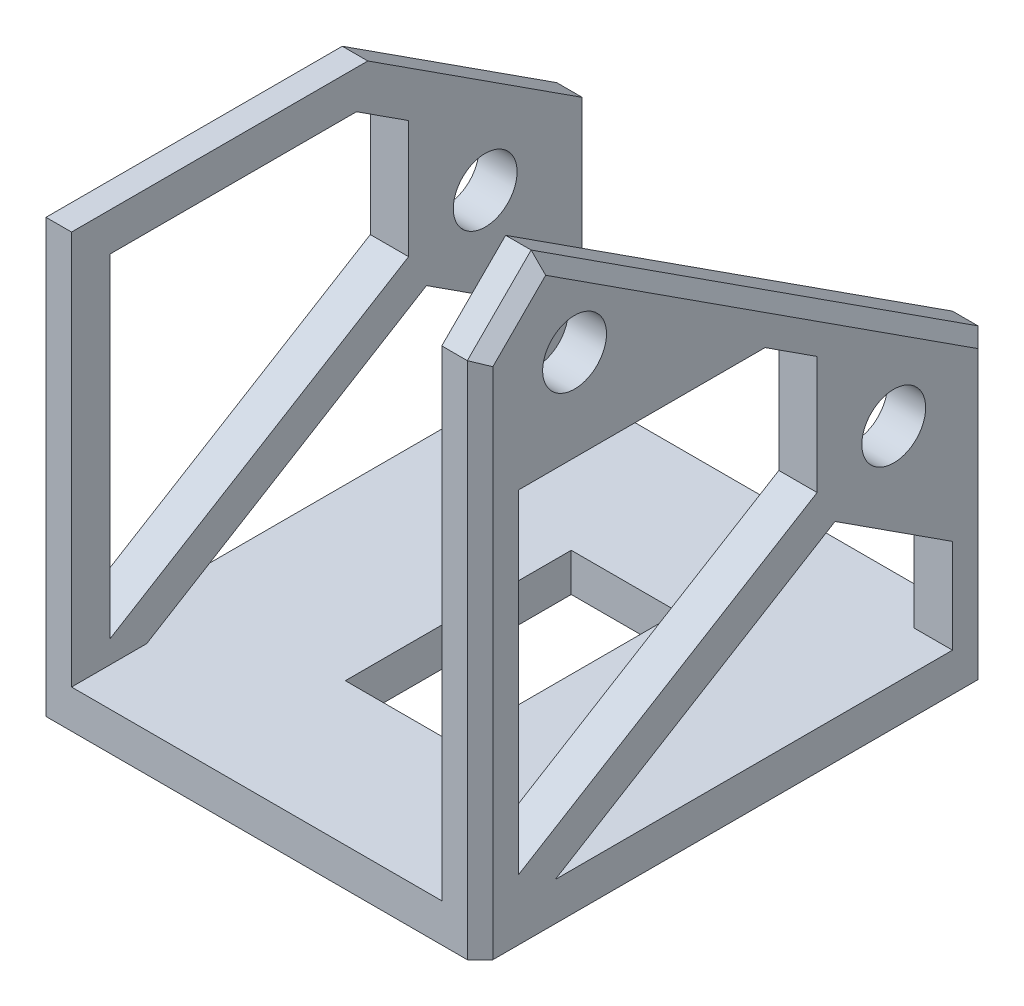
ISO-10303-21;
HEADER;
FILE_DESCRIPTION(('STEP AP214'),'2;1');
FILE_NAME('part.step','',(''),(''),'','','');
FILE_SCHEMA(('AUTOMOTIVE_DESIGN { 1 0 10303 214 1 1 1 1 }'));
ENDSEC;
DATA;
#1=APPLICATION_CONTEXT('core data for automotive mechanical design processes');
#2=APPLICATION_PROTOCOL_DEFINITION('international standard','automotive_design',2000,#1);
#3=PRODUCT_CONTEXT('',#1,'mechanical');
#4=PRODUCT('Part','Part','',(#3));
#5=PRODUCT_RELATED_PRODUCT_CATEGORY('part','',(#4));
#6=PRODUCT_DEFINITION_FORMATION('','',#4);
#7=PRODUCT_DEFINITION_CONTEXT('part definition',#1,'design');
#8=PRODUCT_DEFINITION('design','',#6,#7);
#9=PRODUCT_DEFINITION_SHAPE('','',#8);
#10=(LENGTH_UNIT() NAMED_UNIT(*) SI_UNIT(.MILLI.,.METRE.));
#11=(NAMED_UNIT(*) PLANE_ANGLE_UNIT() SI_UNIT($,.RADIAN.));
#12=(NAMED_UNIT(*) SI_UNIT($,.STERADIAN.) SOLID_ANGLE_UNIT());
#13=UNCERTAINTY_MEASURE_WITH_UNIT(LENGTH_MEASURE(1.E-05),#10,'distance_accuracy_value','');
#14=(GEOMETRIC_REPRESENTATION_CONTEXT(3) GLOBAL_UNCERTAINTY_ASSIGNED_CONTEXT((#13)) GLOBAL_UNIT_ASSIGNED_CONTEXT((#10,
#11,#12)) REPRESENTATION_CONTEXT('',''));
#15=CARTESIAN_POINT('',(0.,0.,0.));
#16=DIRECTION('',(0.,0.,1.));
#17=DIRECTION('',(1.,0.,0.));
#18=AXIS2_PLACEMENT_3D('',#15,#16,#17);
#19=CARTESIAN_POINT('',(0.,1.5,0.));
#20=DIRECTION('',(0.,1.,0.));
#21=DIRECTION('',(0.,0.,1.));
#22=AXIS2_PLACEMENT_3D('',#19,#20,#21);
#23=PLANE('',#22);
#24=DIRECTION('',(0.,0.,1.));
#25=VECTOR('',#24,1.);
#26=CARTESIAN_POINT('',(-14.5,1.5,20.));
#27=LINE('',#26,#25);
#28=CARTESIAN_POINT('',(-14.5,1.5,-20.));
#29=VERTEX_POINT('',#28);
#30=CARTESIAN_POINT('',(-14.5,1.5,-17.));
#31=VERTEX_POINT('',#30);
#32=EDGE_CURVE('E387',#29,#31,#27,.T.);
#33=ORIENTED_EDGE('',*,*,#32,.T.);
#34=DIRECTION('',(1.,0.,0.));
#35=VECTOR('',#34,1.);
#36=CARTESIAN_POINT('',(-17.5,1.5,-17.));
#37=LINE('',#36,#35);
#38=CARTESIAN_POINT('',(-17.5,1.5,-17.));
#39=VERTEX_POINT('',#38);
#40=EDGE_CURVE('E360',#39,#31,#37,.T.);
#41=ORIENTED_EDGE('',*,*,#40,.F.);
#42=DIRECTION('',(0.,0.,-1.));
#43=VECTOR('',#42,1.);
#44=CARTESIAN_POINT('',(-17.5,1.5,14.1138347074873));
#45=LINE('',#44,#43);
#46=CARTESIAN_POINT('',(-17.5,1.5,14.1138347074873));
#47=VERTEX_POINT('',#46);
#48=EDGE_CURVE('E326',#47,#39,#45,.T.);
#49=ORIENTED_EDGE('',*,*,#48,.F.);
#50=DIRECTION('',(1.,0.,0.));
#51=VECTOR('',#50,1.);
#52=CARTESIAN_POINT('',(-17.5,1.5,14.1138347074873));
#53=LINE('',#52,#51);
#54=CARTESIAN_POINT('',(-14.5,1.5,14.1138347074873));
#55=VERTEX_POINT('',#54);
#56=EDGE_CURVE('E347',#47,#55,#53,.T.);
#57=ORIENTED_EDGE('',*,*,#56,.T.);
#58=CARTESIAN_POINT('',(-14.5,1.5,20.));
#59=VERTEX_POINT('',#58);
#60=EDGE_CURVE('E382',#55,#59,#27,.T.);
#61=ORIENTED_EDGE('',*,*,#60,.T.);
#62=DIRECTION('',(1.,0.,0.));
#63=VECTOR('',#62,1.);
#64=CARTESIAN_POINT('',(-17.5,1.5,20.));
#65=LINE('',#64,#63);
#66=CARTESIAN_POINT('',(14.5,1.5,20.));
#67=VERTEX_POINT('',#66);
#68=EDGE_CURVE('E482',#59,#67,#65,.T.);
#69=ORIENTED_EDGE('',*,*,#68,.T.);
#70=DIRECTION('',(0.,0.,-1.));
#71=VECTOR('',#70,1.);
#72=CARTESIAN_POINT('',(14.5,1.5,20.));
#73=LINE('',#72,#71);
#74=CARTESIAN_POINT('',(14.5,1.5,14.1138347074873));
#75=VERTEX_POINT('',#74);
#76=EDGE_CURVE('E424',#67,#75,#73,.T.);
#77=ORIENTED_EDGE('',*,*,#76,.T.);
#78=CARTESIAN_POINT('',(17.5,1.5,14.1138347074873));
#79=VERTEX_POINT('',#78);
#80=EDGE_CURVE('E351',#75,#79,#53,.T.);
#81=ORIENTED_EDGE('',*,*,#80,.T.);
#82=DIRECTION('',(0.,0.,-1.));
#83=VECTOR('',#82,1.);
#84=CARTESIAN_POINT('',(17.5,1.5,14.1138347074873));
#85=LINE('',#84,#83);
#86=CARTESIAN_POINT('',(17.5,1.5,-17.));
#87=VERTEX_POINT('',#86);
#88=EDGE_CURVE('E62',#79,#87,#85,.T.);
#89=ORIENTED_EDGE('',*,*,#88,.T.);
#90=CARTESIAN_POINT('',(14.5,1.5,-17.));
#91=VERTEX_POINT('',#90);
#92=EDGE_CURVE('E338',#91,#87,#37,.T.);
#93=ORIENTED_EDGE('',*,*,#92,.F.);
#94=CARTESIAN_POINT('',(14.5,1.5,-20.));
#95=VERTEX_POINT('',#94);
#96=EDGE_CURVE('E421',#91,#95,#73,.T.);
#97=ORIENTED_EDGE('',*,*,#96,.T.);
#98=DIRECTION('',(-1.,0.,0.));
#99=VECTOR('',#98,1.);
#100=CARTESIAN_POINT('',(-17.5,1.5,-20.));
#101=LINE('',#100,#99);
#102=EDGE_CURVE('E480',#95,#29,#101,.T.);
#103=ORIENTED_EDGE('',*,*,#102,.T.);
#104=EDGE_LOOP('',(#33,#41,#49,#57,#61,#69,#77,#81,#89,#93,#97,#103));
#105=FACE_BOUND('',#104,.T.);
#106=DIRECTION('',(-1.,0.,0.));
#107=VECTOR('',#106,1.);
#108=CARTESIAN_POINT('',(-4.2067741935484,1.5,-8.8475806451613));
#109=LINE('',#108,#107);
#110=CARTESIAN_POINT('',(4.2067741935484,1.5,-8.8475806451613));
#111=VERTEX_POINT('',#110);
#112=CARTESIAN_POINT('',(-4.2067741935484,1.5,-8.8475806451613));
#113=VERTEX_POINT('',#112);
#114=EDGE_CURVE('E451',#111,#113,#109,.T.);
#115=ORIENTED_EDGE('',*,*,#114,.F.);
#116=DIRECTION('',(0.,0.,-1.));
#117=VECTOR('',#116,1.);
#118=CARTESIAN_POINT('',(4.2067741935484,1.5,-8.8475806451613));
#119=LINE('',#118,#117);
#120=CARTESIAN_POINT('',(4.2067741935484,1.5,8.84758064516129));
#121=VERTEX_POINT('',#120);
#122=EDGE_CURVE('E449',#121,#111,#119,.T.);
#123=ORIENTED_EDGE('',*,*,#122,.F.);
#124=DIRECTION('',(1.,0.,0.));
#125=VECTOR('',#124,1.);
#126=CARTESIAN_POINT('',(-4.2067741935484,1.5,8.84758064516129));
#127=LINE('',#126,#125);
#128=CARTESIAN_POINT('',(-4.2067741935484,1.5,8.84758064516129));
#129=VERTEX_POINT('',#128);
#130=EDGE_CURVE('E457',#129,#121,#127,.T.);
#131=ORIENTED_EDGE('',*,*,#130,.F.);
#132=DIRECTION('',(0.,0.,1.));
#133=VECTOR('',#132,1.);
#134=CARTESIAN_POINT('',(-4.2067741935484,1.5,-8.8475806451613));
#135=LINE('',#134,#133);
#136=EDGE_CURVE('E454',#113,#129,#135,.T.);
#137=ORIENTED_EDGE('',*,*,#136,.F.);
#138=EDGE_LOOP('',(#115,#123,#131,#137));
#139=FACE_BOUND('',#138,.T.);
#140=ADVANCED_FACE('F38',(#105,#139),#23,.T.);
#141=CARTESIAN_POINT('',(0.,-1.5,0.));
#142=DIRECTION('',(0.,1.,0.));
#143=DIRECTION('',(0.,0.,1.));
#144=AXIS2_PLACEMENT_3D('',#141,#142,#143);
#145=PLANE('',#144);
#146=DIRECTION('',(0.,0.,1.));
#147=VECTOR('',#146,1.);
#148=CARTESIAN_POINT('',(-17.5,-1.5,-20.));
#149=LINE('',#148,#147);
#150=CARTESIAN_POINT('',(-17.5,-1.5,-19.));
#151=VERTEX_POINT('',#150);
#152=CARTESIAN_POINT('',(-17.5,-1.5,19.));
#153=VERTEX_POINT('',#152);
#154=EDGE_CURVE('E491',#151,#153,#149,.T.);
#155=ORIENTED_EDGE('',*,*,#154,.F.);
#156=DIRECTION('',(-0.707106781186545,0.,0.70710678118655));
#157=VECTOR('',#156,1.);
#158=CARTESIAN_POINT('',(-17.5,-1.5,-19.));
#159=LINE('',#158,#157);
#160=CARTESIAN_POINT('',(-16.5,-1.5,-20.));
#161=VERTEX_POINT('',#160);
#162=EDGE_CURVE('E510',#151,#161,#159,.F.);
#163=ORIENTED_EDGE('',*,*,#162,.T.);
#164=DIRECTION('',(-1.,0.,0.));
#165=VECTOR('',#164,1.);
#166=CARTESIAN_POINT('',(-17.5,-1.5,-20.));
#167=LINE('',#166,#165);
#168=CARTESIAN_POINT('',(16.5,-1.5,-20.));
#169=VERTEX_POINT('',#168);
#170=EDGE_CURVE('E488',#169,#161,#167,.T.);
#171=ORIENTED_EDGE('',*,*,#170,.F.);
#172=DIRECTION('',(-0.707106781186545,0.,-0.70710678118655));
#173=VECTOR('',#172,1.);
#174=CARTESIAN_POINT('',(16.5,-1.5,-20.));
#175=LINE('',#174,#173);
#176=CARTESIAN_POINT('',(17.5,-1.5,-19.));
#177=VERTEX_POINT('',#176);
#178=EDGE_CURVE('E506',#169,#177,#175,.F.);
#179=ORIENTED_EDGE('',*,*,#178,.T.);
#180=DIRECTION('',(0.,0.,-1.));
#181=VECTOR('',#180,1.);
#182=CARTESIAN_POINT('',(17.5,-1.5,-20.));
#183=LINE('',#182,#181);
#184=CARTESIAN_POINT('',(17.5,-1.5,19.));
#185=VERTEX_POINT('',#184);
#186=EDGE_CURVE('E479',#185,#177,#183,.T.);
#187=ORIENTED_EDGE('',*,*,#186,.F.);
#188=DIRECTION('',(0.707106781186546,0.,-0.707106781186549));
#189=VECTOR('',#188,1.);
#190=CARTESIAN_POINT('',(17.5,-1.5,19.));
#191=LINE('',#190,#189);
#192=CARTESIAN_POINT('',(16.5,-1.5,20.));
#193=VERTEX_POINT('',#192);
#194=EDGE_CURVE('E504',#185,#193,#191,.F.);
#195=ORIENTED_EDGE('',*,*,#194,.T.);
#196=DIRECTION('',(1.,0.,0.));
#197=VECTOR('',#196,1.);
#198=CARTESIAN_POINT('',(-17.5,-1.5,20.));
#199=LINE('',#198,#197);
#200=CARTESIAN_POINT('',(-16.5,-1.5,20.));
#201=VERTEX_POINT('',#200);
#202=EDGE_CURVE('E483',#201,#193,#199,.T.);
#203=ORIENTED_EDGE('',*,*,#202,.F.);
#204=DIRECTION('',(0.707106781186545,0.,0.70710678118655));
#205=VECTOR('',#204,1.);
#206=CARTESIAN_POINT('',(-16.5,-1.5,20.));
#207=LINE('',#206,#205);
#208=EDGE_CURVE('E508',#201,#153,#207,.F.);
#209=ORIENTED_EDGE('',*,*,#208,.T.);
#210=EDGE_LOOP('',(#155,#163,#171,#179,#187,#195,#203,#209));
#211=FACE_BOUND('',#210,.T.);
#212=DIRECTION('',(0.,0.,-1.));
#213=VECTOR('',#212,1.);
#214=CARTESIAN_POINT('',(4.2067741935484,-1.5,-8.8475806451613));
#215=LINE('',#214,#213);
#216=CARTESIAN_POINT('',(4.2067741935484,-1.5,8.84758064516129));
#217=VERTEX_POINT('',#216);
#218=CARTESIAN_POINT('',(4.2067741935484,-1.5,-8.8475806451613));
#219=VERTEX_POINT('',#218);
#220=EDGE_CURVE('E443',#217,#219,#215,.T.);
#221=ORIENTED_EDGE('',*,*,#220,.T.);
#222=DIRECTION('',(-1.,0.,0.));
#223=VECTOR('',#222,1.);
#224=CARTESIAN_POINT('',(-4.2067741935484,-1.5,-8.8475806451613));
#225=LINE('',#224,#223);
#226=CARTESIAN_POINT('',(-4.2067741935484,-1.5,-8.8475806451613));
#227=VERTEX_POINT('',#226);
#228=EDGE_CURVE('E462',#219,#227,#225,.T.);
#229=ORIENTED_EDGE('',*,*,#228,.T.);
#230=DIRECTION('',(0.,0.,1.));
#231=VECTOR('',#230,1.);
#232=CARTESIAN_POINT('',(-4.2067741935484,-1.5,-8.8475806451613));
#233=LINE('',#232,#231);
#234=CARTESIAN_POINT('',(-4.2067741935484,-1.5,8.84758064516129));
#235=VERTEX_POINT('',#234);
#236=EDGE_CURVE('E465',#227,#235,#233,.T.);
#237=ORIENTED_EDGE('',*,*,#236,.T.);
#238=DIRECTION('',(1.,0.,0.));
#239=VECTOR('',#238,1.);
#240=CARTESIAN_POINT('',(-4.2067741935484,-1.5,8.84758064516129));
#241=LINE('',#240,#239);
#242=EDGE_CURVE('E452',#235,#217,#241,.T.);
#243=ORIENTED_EDGE('',*,*,#242,.T.);
#244=EDGE_LOOP('',(#221,#229,#237,#243));
#245=FACE_BOUND('',#244,.T.);
#246=ADVANCED_FACE('F623',(#211,#245),#145,.F.);
#247=CARTESIAN_POINT('',(17.5,1.5,-20.));
#248=DIRECTION('',(-1.,0.,0.));
#249=DIRECTION('',(0.,0.,1.));
#250=AXIS2_PLACEMENT_3D('',#247,#248,#249);
#251=PLANE('',#250);
#252=DIRECTION('',(0.,0.543154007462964,0.839633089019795));
#253=VECTOR('',#252,1.);
#254=CARTESIAN_POINT('',(17.5,26.7243500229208,-6.40065792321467));
#255=LINE('',#254,#253);
#256=CARTESIAN_POINT('',(17.5,26.7243500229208,-6.40065792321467));
#257=VERTEX_POINT('',#256);
#258=CARTESIAN_POINT('',(17.5,29.3630801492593,-2.32158440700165));
#259=VERTEX_POINT('',#258);
#260=EDGE_CURVE('E303',#257,#259,#255,.T.);
#261=ORIENTED_EDGE('',*,*,#260,.F.);
#262=DIRECTION('',(0.,1.,0.));
#263=VECTOR('',#262,1.);
#264=CARTESIAN_POINT('',(17.5,17.4911374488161,-6.40065792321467));
#265=LINE('',#264,#263);
#266=CARTESIAN_POINT('',(17.5,17.4911374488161,-6.40065792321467));
#267=VERTEX_POINT('',#266);
#268=EDGE_CURVE('E54',#267,#257,#265,.T.);
#269=ORIENTED_EDGE('',*,*,#268,.F.);
#270=DIRECTION('',(0.,0.519720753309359,-0.85433619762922));
#271=VECTOR('',#270,1.);
#272=CARTESIAN_POINT('',(17.5,3.2557490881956,17.));
#273=LINE('',#272,#271);
#274=CARTESIAN_POINT('',(17.5,3.2557490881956,17.));
#275=VERTEX_POINT('',#274);
#276=EDGE_CURVE('E288',#275,#267,#273,.T.);
#277=ORIENTED_EDGE('',*,*,#276,.F.);
#278=DIRECTION('',(0.,-1.,0.));
#279=VECTOR('',#278,1.);
#280=CARTESIAN_POINT('',(17.5,29.3630801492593,17.));
#281=LINE('',#280,#279);
#282=CARTESIAN_POINT('',(17.5,29.3630801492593,17.));
#283=VERTEX_POINT('',#282);
#284=EDGE_CURVE('E295',#283,#275,#281,.T.);
#285=ORIENTED_EDGE('',*,*,#284,.F.);
#286=DIRECTION('',(0.,0.,1.));
#287=VECTOR('',#286,1.);
#288=CARTESIAN_POINT('',(17.5,29.3630801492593,-2.32158440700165));
#289=LINE('',#288,#287);
#290=EDGE_CURVE('E307',#259,#283,#289,.T.);
#291=ORIENTED_EDGE('',*,*,#290,.F.);
#292=EDGE_LOOP('',(#261,#269,#277,#285,#291));
#293=FACE_BOUND('',#292,.T.);
#294=DIRECTION('',(0.,1.,0.));
#295=VECTOR('',#294,1.);
#296=CARTESIAN_POINT('',(17.5,1.5,-17.));
#297=LINE('',#296,#295);
#298=CARTESIAN_POINT('',(17.5,8.87873251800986,-17.));
#299=VERTEX_POINT('',#298);
#300=EDGE_CURVE('E305',#87,#299,#297,.T.);
#301=ORIENTED_EDGE('',*,*,#300,.F.);
#302=ORIENTED_EDGE('',*,*,#88,.F.);
#303=DIRECTION('',(0.,-0.519720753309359,0.854336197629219));
#304=VECTOR('',#303,1.);
#305=CARTESIAN_POINT('',(17.5,14.8305447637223,-7.79940784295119));
#306=LINE('',#305,#304);
#307=CARTESIAN_POINT('',(17.5,14.8305447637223,-7.79940784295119));
#308=VERTEX_POINT('',#307);
#309=EDGE_CURVE('E330',#308,#79,#306,.T.);
#310=ORIENTED_EDGE('',*,*,#309,.F.);
#311=DIRECTION('',(0.,0.543154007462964,0.839633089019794));
#312=VECTOR('',#311,1.);
#313=CARTESIAN_POINT('',(17.5,8.87873251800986,-17.));
#314=LINE('',#313,#312);
#315=EDGE_CURVE('E342',#299,#308,#314,.T.);
#316=ORIENTED_EDGE('',*,*,#315,.F.);
#317=EDGE_LOOP('',(#301,#302,#310,#316));
#318=FACE_BOUND('',#317,.T.);
#319=ORIENTED_EDGE('',*,*,#186,.T.);
#320=DIRECTION('',(0.,1.,0.));
#321=VECTOR('',#320,1.);
#322=CARTESIAN_POINT('',(17.5,1.5,-19.));
#323=LINE('',#322,#321);
#324=CARTESIAN_POINT('',(17.5,20.9558980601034,-19.));
#325=VERTEX_POINT('',#324);
#326=EDGE_CURVE('E531',#177,#325,#323,.T.);
#327=ORIENTED_EDGE('',*,*,#326,.T.);
#328=DIRECTION('',(0.,0.543154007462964,0.839633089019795));
#329=VECTOR('',#328,1.);
#330=CARTESIAN_POINT('',(17.5,43.3016735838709,15.543154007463));
#331=LINE('',#330,#329);
#332=CARTESIAN_POINT('',(17.5,42.8626313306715,14.8644617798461));
#333=VERTEX_POINT('',#332);
#334=EDGE_CURVE('E525',#325,#333,#331,.T.);
#335=ORIENTED_EDGE('',*,*,#334,.T.);
#336=DIRECTION('',(0.,-0.707106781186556,0.707106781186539));
#337=VECTOR('',#336,1.);
#338=CARTESIAN_POINT('',(17.5,38.4341998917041,19.2928932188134));
#339=LINE('',#338,#337);
#340=CARTESIAN_POINT('',(17.5,38.7270931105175,19.));
#341=VERTEX_POINT('',#340);
#342=EDGE_CURVE('E527',#333,#341,#339,.T.);
#343=ORIENTED_EDGE('',*,*,#342,.T.);
#344=DIRECTION('',(0.,-1.,0.));
#345=VECTOR('',#344,1.);
#346=CARTESIAN_POINT('',(17.5,1.5,19.));
#347=LINE('',#346,#345);
#348=EDGE_CURVE('E529',#341,#185,#347,.T.);
#349=ORIENTED_EDGE('',*,*,#348,.T.);
#350=EDGE_LOOP('',(#319,#327,#335,#343,#349));
#351=FACE_BOUND('',#350,.T.);
#352=CARTESIAN_POINT('',(17.5,36.51,12.5993420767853));
#353=DIRECTION('',(1.,0.,0.));
#354=DIRECTION('',(0.,0.,-1.));
#355=AXIS2_PLACEMENT_3D('',#352,#353,#354);
#356=CIRCLE('',#355,2.5);
#357=CARTESIAN_POINT('',(17.5,36.51,10.0993420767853));
#358=VERTEX_POINT('',#357);
#359=EDGE_CURVE('E406',#358,#358,#356,.T.);
#360=ORIENTED_EDGE('',*,*,#359,.F.);
#361=EDGE_LOOP('',(#360));
#362=FACE_BOUND('',#361,.T.);
#363=CARTESIAN_POINT('',(17.5,19.,-12.4006579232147));
#364=DIRECTION('',(1.,0.,0.));
#365=DIRECTION('',(0.,0.,-1.));
#366=AXIS2_PLACEMENT_3D('',#363,#364,#365);
#367=CIRCLE('',#366,2.5);
#368=CARTESIAN_POINT('',(17.5,19.,-14.9006579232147));
#369=VERTEX_POINT('',#368);
#370=EDGE_CURVE('E415',#369,#369,#367,.T.);
#371=ORIENTED_EDGE('',*,*,#370,.F.);
#372=EDGE_LOOP('',(#371));
#373=FACE_BOUND('',#372,.T.);
#374=ADVANCED_FACE('F299',(#293,#318,#351,#362,#373),#251,.F.);
#375=CARTESIAN_POINT('',(-17.5,1.5,-20.));
#376=DIRECTION('',(0.,0.,1.));
#377=DIRECTION('',(1.,0.,0.));
#378=AXIS2_PLACEMENT_3D('',#375,#376,#377);
#379=PLANE('',#378);
#380=ORIENTED_EDGE('',*,*,#170,.T.);
#381=DIRECTION('',(0.,1.,0.));
#382=VECTOR('',#381,1.);
#383=CARTESIAN_POINT('',(-16.5,1.5,-20.));
#384=LINE('',#383,#382);
#385=CARTESIAN_POINT('',(-16.5,21.5,-20.));
#386=VERTEX_POINT('',#385);
#387=EDGE_CURVE('E515',#161,#386,#384,.T.);
#388=ORIENTED_EDGE('',*,*,#387,.T.);
#389=DIRECTION('',(-1.,0.,0.));
#390=VECTOR('',#389,1.);
#391=CARTESIAN_POINT('',(-14.5,21.5,-20.));
#392=LINE('',#391,#390);
#393=CARTESIAN_POINT('',(-14.5,21.5,-20.));
#394=VERTEX_POINT('',#393);
#395=EDGE_CURVE('E403',#394,#386,#392,.T.);
#396=ORIENTED_EDGE('',*,*,#395,.F.);
#397=DIRECTION('',(0.,-1.,0.));
#398=VECTOR('',#397,1.);
#399=CARTESIAN_POINT('',(-14.5,1.5,-20.));
#400=LINE('',#399,#398);
#401=EDGE_CURVE('E399',#394,#29,#400,.T.);
#402=ORIENTED_EDGE('',*,*,#401,.T.);
#403=ORIENTED_EDGE('',*,*,#102,.F.);
#404=DIRECTION('',(0.,1.,0.));
#405=VECTOR('',#404,1.);
#406=CARTESIAN_POINT('',(14.5,21.5,-20.));
#407=LINE('',#406,#405);
#408=CARTESIAN_POINT('',(14.5,21.5,-20.));
#409=VERTEX_POINT('',#408);
#410=EDGE_CURVE('E427',#95,#409,#407,.T.);
#411=ORIENTED_EDGE('',*,*,#410,.T.);
#412=DIRECTION('',(1.,0.,0.));
#413=VECTOR('',#412,1.);
#414=CARTESIAN_POINT('',(14.5,21.5,-20.));
#415=LINE('',#414,#413);
#416=CARTESIAN_POINT('',(16.5,21.5,-20.));
#417=VERTEX_POINT('',#416);
#418=EDGE_CURVE('E439',#409,#417,#415,.T.);
#419=ORIENTED_EDGE('',*,*,#418,.T.);
#420=DIRECTION('',(0.,-1.,0.));
#421=VECTOR('',#420,1.);
#422=CARTESIAN_POINT('',(16.5,1.5,-20.));
#423=LINE('',#422,#421);
#424=EDGE_CURVE('E512',#417,#169,#423,.T.);
#425=ORIENTED_EDGE('',*,*,#424,.T.);
#426=EDGE_LOOP('',(#380,#388,#396,#402,#403,#411,#419,#425));
#427=FACE_BOUND('',#426,.T.);
#428=ADVANCED_FACE('F642',(#427),#379,.F.);
#429=CARTESIAN_POINT('',(-17.5,1.5,-20.));
#430=DIRECTION('',(1.,0.,0.));
#431=DIRECTION('',(0.,0.,-1.));
#432=AXIS2_PLACEMENT_3D('',#429,#430,#431);
#433=PLANE('',#432);
#434=DIRECTION('',(0.,0.519720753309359,-0.85433619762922));
#435=VECTOR('',#434,1.);
#436=CARTESIAN_POINT('',(-17.5,3.2557490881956,17.));
#437=LINE('',#436,#435);
#438=CARTESIAN_POINT('',(-17.5,3.2557490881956,17.));
#439=VERTEX_POINT('',#438);
#440=CARTESIAN_POINT('',(-17.5,17.4911374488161,-6.40065792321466));
#441=VERTEX_POINT('',#440);
#442=EDGE_CURVE('E311',#439,#441,#437,.T.);
#443=ORIENTED_EDGE('',*,*,#442,.T.);
#444=DIRECTION('',(0.,1.,0.));
#445=VECTOR('',#444,1.);
#446=CARTESIAN_POINT('',(-17.5,17.4911374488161,-6.40065792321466));
#447=LINE('',#446,#445);
#448=CARTESIAN_POINT('',(-17.5,26.7243500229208,-6.40065792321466));
#449=VERTEX_POINT('',#448);
#450=EDGE_CURVE('E296',#441,#449,#447,.T.);
#451=ORIENTED_EDGE('',*,*,#450,.T.);
#452=DIRECTION('',(0.,0.543154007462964,0.839633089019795));
#453=VECTOR('',#452,1.);
#454=CARTESIAN_POINT('',(-17.5,26.7243500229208,-6.40065792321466));
#455=LINE('',#454,#453);
#456=CARTESIAN_POINT('',(-17.5,29.3630801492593,-2.32158440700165));
#457=VERTEX_POINT('',#456);
#458=EDGE_CURVE('E321',#449,#457,#455,.T.);
#459=ORIENTED_EDGE('',*,*,#458,.T.);
#460=DIRECTION('',(0.,0.,1.));
#461=VECTOR('',#460,1.);
#462=CARTESIAN_POINT('',(-17.5,29.3630801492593,-2.32158440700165));
#463=LINE('',#462,#461);
#464=CARTESIAN_POINT('',(-17.5,29.3630801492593,17.));
#465=VERTEX_POINT('',#464);
#466=EDGE_CURVE('E318',#457,#465,#463,.T.);
#467=ORIENTED_EDGE('',*,*,#466,.T.);
#468=DIRECTION('',(0.,-1.,0.));
#469=VECTOR('',#468,1.);
#470=CARTESIAN_POINT('',(-17.5,29.3630801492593,17.));
#471=LINE('',#470,#469);
#472=EDGE_CURVE('E314',#465,#439,#471,.T.);
#473=ORIENTED_EDGE('',*,*,#472,.T.);
#474=EDGE_LOOP('',(#443,#451,#459,#467,#473));
#475=FACE_BOUND('',#474,.T.);
#476=DIRECTION('',(0.,-0.519720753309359,0.854336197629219));
#477=VECTOR('',#476,1.);
#478=CARTESIAN_POINT('',(-17.5,14.8305447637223,-7.79940784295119));
#479=LINE('',#478,#477);
#480=CARTESIAN_POINT('',(-17.5,14.8305447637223,-7.79940784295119));
#481=VERTEX_POINT('',#480);
#482=EDGE_CURVE('E336',#481,#47,#479,.T.);
#483=ORIENTED_EDGE('',*,*,#482,.T.);
#484=ORIENTED_EDGE('',*,*,#48,.T.);
#485=DIRECTION('',(0.,1.,0.));
#486=VECTOR('',#485,1.);
#487=CARTESIAN_POINT('',(-17.5,1.5,-17.));
#488=LINE('',#487,#486);
#489=CARTESIAN_POINT('',(-17.5,8.87873251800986,-17.));
#490=VERTEX_POINT('',#489);
#491=EDGE_CURVE('E329',#39,#490,#488,.T.);
#492=ORIENTED_EDGE('',*,*,#491,.T.);
#493=DIRECTION('',(0.,0.543154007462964,0.839633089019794));
#494=VECTOR('',#493,1.);
#495=CARTESIAN_POINT('',(-17.5,8.87873251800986,-17.));
#496=LINE('',#495,#494);
#497=EDGE_CURVE('E333',#490,#481,#496,.T.);
#498=ORIENTED_EDGE('',*,*,#497,.T.);
#499=EDGE_LOOP('',(#483,#484,#492,#498));
#500=FACE_BOUND('',#499,.T.);
#501=DIRECTION('',(0.,-0.543154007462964,-0.839633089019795));
#502=VECTOR('',#501,1.);
#503=CARTESIAN_POINT('',(-17.5,20.6603669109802,-19.456845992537));
#504=LINE('',#503,#502);
#505=CARTESIAN_POINT('',(-17.5,31.3630801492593,-2.91208694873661));
#506=VERTEX_POINT('',#505);
#507=CARTESIAN_POINT('',(-17.5,20.9558980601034,-19.));
#508=VERTEX_POINT('',#507);
#509=EDGE_CURVE('E499',#506,#508,#504,.T.);
#510=ORIENTED_EDGE('',*,*,#509,.T.);
#511=DIRECTION('',(0.,-1.,0.));
#512=VECTOR('',#511,1.);
#513=CARTESIAN_POINT('',(-17.5,1.5,-19.));
#514=LINE('',#513,#512);
#515=EDGE_CURVE('E501',#508,#151,#514,.T.);
#516=ORIENTED_EDGE('',*,*,#515,.T.);
#517=ORIENTED_EDGE('',*,*,#154,.T.);
#518=DIRECTION('',(0.,1.,0.));
#519=VECTOR('',#518,1.);
#520=CARTESIAN_POINT('',(-17.5,1.5,19.));
#521=LINE('',#520,#519);
#522=CARTESIAN_POINT('',(-17.5,31.3630801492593,19.));
#523=VERTEX_POINT('',#522);
#524=EDGE_CURVE('E485',#153,#523,#521,.T.);
#525=ORIENTED_EDGE('',*,*,#524,.T.);
#526=DIRECTION('',(0.,0.,-1.));
#527=VECTOR('',#526,1.);
#528=CARTESIAN_POINT('',(-17.5,31.3630801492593,-3.2073382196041));
#529=LINE('',#528,#527);
#530=EDGE_CURVE('E497',#523,#506,#529,.T.);
#531=ORIENTED_EDGE('',*,*,#530,.T.);
#532=EDGE_LOOP('',(#510,#516,#517,#525,#531));
#533=FACE_BOUND('',#532,.T.);
#534=CARTESIAN_POINT('',(-17.5,19.,-12.4006579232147));
#535=DIRECTION('',(-1.,0.,0.));
#536=DIRECTION('',(0.,0.,1.));
#537=AXIS2_PLACEMENT_3D('',#534,#535,#536);
#538=CIRCLE('',#537,2.5);
#539=CARTESIAN_POINT('',(-17.5,19.,-9.90065792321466));
#540=VERTEX_POINT('',#539);
#541=EDGE_CURVE('E383',#540,#540,#538,.T.);
#542=ORIENTED_EDGE('',*,*,#541,.F.);
#543=EDGE_LOOP('',(#542));
#544=FACE_BOUND('',#543,.T.);
#545=ADVANCED_FACE('F638',(#475,#500,#533,#544),#433,.F.);
#546=CARTESIAN_POINT('',(-17.5,1.5,20.));
#547=DIRECTION('',(0.,0.,-1.));
#548=DIRECTION('',(-1.,0.,0.));
#549=AXIS2_PLACEMENT_3D('',#546,#547,#548);
#550=PLANE('',#549);
#551=DIRECTION('',(-1.,0.,0.));
#552=VECTOR('',#551,1.);
#553=CARTESIAN_POINT('',(-14.5,32.3630801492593,20.));
#554=LINE('',#553,#552);
#555=CARTESIAN_POINT('',(-14.5,32.3630801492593,20.));
#556=VERTEX_POINT('',#555);
#557=CARTESIAN_POINT('',(-16.5,32.3630801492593,20.));
#558=VERTEX_POINT('',#557);
#559=EDGE_CURVE('E402',#556,#558,#554,.T.);
#560=ORIENTED_EDGE('',*,*,#559,.T.);
#561=DIRECTION('',(0.,-1.,0.));
#562=VECTOR('',#561,1.);
#563=CARTESIAN_POINT('',(-16.5,1.5,20.));
#564=LINE('',#563,#562);
#565=EDGE_CURVE('E523',#558,#201,#564,.T.);
#566=ORIENTED_EDGE('',*,*,#565,.T.);
#567=ORIENTED_EDGE('',*,*,#202,.T.);
#568=DIRECTION('',(0.,1.,0.));
#569=VECTOR('',#568,1.);
#570=CARTESIAN_POINT('',(16.5,1.5,20.));
#571=LINE('',#570,#569);
#572=CARTESIAN_POINT('',(16.5,39.1413066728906,20.));
#573=VERTEX_POINT('',#572);
#574=EDGE_CURVE('E521',#193,#573,#571,.T.);
#575=ORIENTED_EDGE('',*,*,#574,.T.);
#576=DIRECTION('',(1.,0.,0.));
#577=VECTOR('',#576,1.);
#578=CARTESIAN_POINT('',(14.5,39.1413066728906,20.));
#579=LINE('',#578,#577);
#580=CARTESIAN_POINT('',(14.5,39.1413066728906,20.));
#581=VERTEX_POINT('',#580);
#582=EDGE_CURVE('E440',#581,#573,#579,.T.);
#583=ORIENTED_EDGE('',*,*,#582,.F.);
#584=DIRECTION('',(0.,-1.,0.));
#585=VECTOR('',#584,1.);
#586=CARTESIAN_POINT('',(14.5,1.5,20.));
#587=LINE('',#586,#585);
#588=EDGE_CURVE('E436',#581,#67,#587,.T.);
#589=ORIENTED_EDGE('',*,*,#588,.T.);
#590=ORIENTED_EDGE('',*,*,#68,.F.);
#591=DIRECTION('',(0.,1.,0.));
#592=VECTOR('',#591,1.);
#593=CARTESIAN_POINT('',(-14.5,32.3630801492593,20.));
#594=LINE('',#593,#592);
#595=EDGE_CURVE('E390',#59,#556,#594,.T.);
#596=ORIENTED_EDGE('',*,*,#595,.T.);
#597=EDGE_LOOP('',(#560,#566,#567,#575,#583,#589,#590,#596));
#598=FACE_BOUND('',#597,.T.);
#599=ADVANCED_FACE('F635',(#598),#550,.F.);
#600=CARTESIAN_POINT('',(4.2067741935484,1.5,-8.8475806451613));
#601=DIRECTION('',(-1.,0.,0.));
#602=DIRECTION('',(0.,0.,1.));
#603=AXIS2_PLACEMENT_3D('',#600,#601,#602);
#604=PLANE('',#603);
#605=ORIENTED_EDGE('',*,*,#220,.F.);
#606=DIRECTION('',(0.,-1.,0.));
#607=VECTOR('',#606,1.);
#608=CARTESIAN_POINT('',(4.2067741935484,1.5,8.84758064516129));
#609=LINE('',#608,#607);
#610=EDGE_CURVE('E459',#121,#217,#609,.T.);
#611=ORIENTED_EDGE('',*,*,#610,.F.);
#612=ORIENTED_EDGE('',*,*,#122,.T.);
#613=DIRECTION('',(0.,-1.,0.));
#614=VECTOR('',#613,1.);
#615=CARTESIAN_POINT('',(4.2067741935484,1.5,-8.8475806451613));
#616=LINE('',#615,#614);
#617=EDGE_CURVE('E476',#111,#219,#616,.T.);
#618=ORIENTED_EDGE('',*,*,#617,.T.);
#619=EDGE_LOOP('',(#605,#611,#612,#618));
#620=FACE_BOUND('',#619,.T.);
#621=ADVANCED_FACE('F632',(#620),#604,.T.);
#622=CARTESIAN_POINT('',(-4.2067741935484,1.5,-8.8475806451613));
#623=DIRECTION('',(0.,0.,1.));
#624=DIRECTION('',(1.,0.,0.));
#625=AXIS2_PLACEMENT_3D('',#622,#623,#624);
#626=PLANE('',#625);
#627=ORIENTED_EDGE('',*,*,#228,.F.);
#628=ORIENTED_EDGE('',*,*,#617,.F.);
#629=ORIENTED_EDGE('',*,*,#114,.T.);
#630=DIRECTION('',(0.,-1.,0.));
#631=VECTOR('',#630,1.);
#632=CARTESIAN_POINT('',(-4.2067741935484,1.5,-8.8475806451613));
#633=LINE('',#632,#631);
#634=EDGE_CURVE('E474',#113,#227,#633,.T.);
#635=ORIENTED_EDGE('',*,*,#634,.T.);
#636=EDGE_LOOP('',(#627,#628,#629,#635));
#637=FACE_BOUND('',#636,.T.);
#638=ADVANCED_FACE('F1076',(#637),#626,.T.);
#639=CARTESIAN_POINT('',(-4.2067741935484,1.5,-8.8475806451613));
#640=DIRECTION('',(1.,0.,0.));
#641=DIRECTION('',(0.,0.,-1.));
#642=AXIS2_PLACEMENT_3D('',#639,#640,#641);
#643=PLANE('',#642);
#644=ORIENTED_EDGE('',*,*,#236,.F.);
#645=ORIENTED_EDGE('',*,*,#634,.F.);
#646=ORIENTED_EDGE('',*,*,#136,.T.);
#647=DIRECTION('',(0.,-1.,0.));
#648=VECTOR('',#647,1.);
#649=CARTESIAN_POINT('',(-4.2067741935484,1.5,8.84758064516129));
#650=LINE('',#649,#648);
#651=EDGE_CURVE('E472',#129,#235,#650,.T.);
#652=ORIENTED_EDGE('',*,*,#651,.T.);
#653=EDGE_LOOP('',(#644,#645,#646,#652));
#654=FACE_BOUND('',#653,.T.);
#655=ADVANCED_FACE('F1066',(#654),#643,.T.);
#656=CARTESIAN_POINT('',(-4.2067741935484,1.5,8.84758064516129));
#657=DIRECTION('',(0.,0.,-1.));
#658=DIRECTION('',(-1.,0.,0.));
#659=AXIS2_PLACEMENT_3D('',#656,#657,#658);
#660=PLANE('',#659);
#661=ORIENTED_EDGE('',*,*,#242,.F.);
#662=ORIENTED_EDGE('',*,*,#651,.F.);
#663=ORIENTED_EDGE('',*,*,#130,.T.);
#664=ORIENTED_EDGE('',*,*,#610,.T.);
#665=EDGE_LOOP('',(#661,#662,#663,#664));
#666=FACE_BOUND('',#665,.T.);
#667=ADVANCED_FACE('F1048',(#666),#660,.T.);
#668=CARTESIAN_POINT('',(14.5,39.1413066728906,20.));
#669=DIRECTION('',(0.,0.707106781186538,0.707106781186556));
#670=DIRECTION('',(0.,-0.707106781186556,0.707106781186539));
#671=AXIS2_PLACEMENT_3D('',#668,#669,#670);
#672=PLANE('',#671);
#673=ORIENTED_EDGE('',*,*,#582,.T.);
#674=DIRECTION('',(0.,0.707106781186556,-0.707106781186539));
#675=VECTOR('',#674,1.);
#676=CARTESIAN_POINT('',(16.5,44.1413066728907,15.));
#677=LINE('',#676,#675);
#678=CARTESIAN_POINT('',(16.5,44.1413066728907,15.));
#679=VERTEX_POINT('',#678);
#680=EDGE_CURVE('E533',#573,#679,#677,.T.);
#681=ORIENTED_EDGE('',*,*,#680,.T.);
#682=DIRECTION('',(1.,0.,0.));
#683=VECTOR('',#682,1.);
#684=CARTESIAN_POINT('',(14.5,44.1413066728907,15.));
#685=LINE('',#684,#683);
#686=CARTESIAN_POINT('',(14.5,44.1413066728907,15.));
#687=VERTEX_POINT('',#686);
#688=EDGE_CURVE('E444',#687,#679,#685,.T.);
#689=ORIENTED_EDGE('',*,*,#688,.F.);
#690=DIRECTION('',(0.,-0.707106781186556,0.707106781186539));
#691=VECTOR('',#690,1.);
#692=CARTESIAN_POINT('',(14.5,39.1413066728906,20.));
#693=LINE('',#692,#691);
#694=EDGE_CURVE('E433',#687,#581,#693,.T.);
#695=ORIENTED_EDGE('',*,*,#694,.T.);
#696=EDGE_LOOP('',(#673,#681,#689,#695));
#697=FACE_BOUND('',#696,.T.);
#698=ADVANCED_FACE('F729',(#697),#672,.T.);
#699=CARTESIAN_POINT('',(14.5,44.1413066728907,15.));
#700=DIRECTION('',(0.,0.839633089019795,-0.543154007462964));
#701=DIRECTION('',(0.,0.543154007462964,0.839633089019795));
#702=AXIS2_PLACEMENT_3D('',#699,#700,#701);
#703=PLANE('',#702);
#704=ORIENTED_EDGE('',*,*,#688,.T.);
#705=DIRECTION('',(0.,-0.543154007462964,-0.839633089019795));
#706=VECTOR('',#705,1.);
#707=CARTESIAN_POINT('',(16.5,21.5,-20.));
#708=LINE('',#707,#706);
#709=EDGE_CURVE('E535',#679,#417,#708,.T.);
#710=ORIENTED_EDGE('',*,*,#709,.T.);
#711=ORIENTED_EDGE('',*,*,#418,.F.);
#712=DIRECTION('',(0.,0.543154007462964,0.839633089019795));
#713=VECTOR('',#712,1.);
#714=CARTESIAN_POINT('',(14.5,44.1413066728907,15.));
#715=LINE('',#714,#713);
#716=EDGE_CURVE('E430',#409,#687,#715,.T.);
#717=ORIENTED_EDGE('',*,*,#716,.T.);
#718=EDGE_LOOP('',(#704,#710,#711,#717));
#719=FACE_BOUND('',#718,.T.);
#720=ADVANCED_FACE('F726',(#719),#703,.T.);
#721=CARTESIAN_POINT('',(14.5,0.,0.));
#722=DIRECTION('',(-1.,0.,0.));
#723=DIRECTION('',(0.,0.,1.));
#724=AXIS2_PLACEMENT_3D('',#721,#722,#723);
#725=PLANE('',#724);
#726=DIRECTION('',(0.,-1.,0.));
#727=VECTOR('',#726,1.);
#728=CARTESIAN_POINT('',(14.5,0.,-6.40065792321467));
#729=LINE('',#728,#727);
#730=CARTESIAN_POINT('',(14.5,26.7243500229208,-6.40065792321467));
#731=VERTEX_POINT('',#730);
#732=CARTESIAN_POINT('',(14.5,17.4911374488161,-6.40065792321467));
#733=VERTEX_POINT('',#732);
#734=EDGE_CURVE('E282',#731,#733,#729,.T.);
#735=ORIENTED_EDGE('',*,*,#734,.F.);
#736=DIRECTION('',(0.,-0.543154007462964,-0.839633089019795));
#737=VECTOR('',#736,1.);
#738=CARTESIAN_POINT('',(14.5,21.7592523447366,-14.0759401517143));
#739=LINE('',#738,#737);
#740=CARTESIAN_POINT('',(14.5,29.3630801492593,-2.32158440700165));
#741=VERTEX_POINT('',#740);
#742=EDGE_CURVE('E368',#741,#731,#739,.T.);
#743=ORIENTED_EDGE('',*,*,#742,.F.);
#744=DIRECTION('',(0.,0.,-1.));
#745=VECTOR('',#744,1.);
#746=CARTESIAN_POINT('',(14.5,29.3630801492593,0.));
#747=LINE('',#746,#745);
#748=CARTESIAN_POINT('',(14.5,29.3630801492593,17.));
#749=VERTEX_POINT('',#748);
#750=EDGE_CURVE('E370',#749,#741,#747,.T.);
#751=ORIENTED_EDGE('',*,*,#750,.F.);
#752=DIRECTION('',(0.,1.,0.));
#753=VECTOR('',#752,1.);
#754=CARTESIAN_POINT('',(14.5,0.,17.));
#755=LINE('',#754,#753);
#756=CARTESIAN_POINT('',(14.5,3.2557490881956,17.));
#757=VERTEX_POINT('',#756);
#758=EDGE_CURVE('E373',#757,#749,#755,.T.);
#759=ORIENTED_EDGE('',*,*,#758,.F.);
#760=DIRECTION('',(0.,-0.519720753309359,0.854336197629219));
#761=VECTOR('',#760,1.);
#762=CARTESIAN_POINT('',(14.5,9.92461609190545,6.03746975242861));
#763=LINE('',#762,#761);
#764=EDGE_CURVE('E375',#733,#757,#763,.T.);
#765=ORIENTED_EDGE('',*,*,#764,.F.);
#766=EDGE_LOOP('',(#735,#743,#751,#759,#765));
#767=FACE_BOUND('',#766,.T.);
#768=DIRECTION('',(0.,0.519720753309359,-0.854336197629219));
#769=VECTOR('',#768,1.);
#770=CARTESIAN_POINT('',(14.5,7.36160749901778,4.47830749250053));
#771=LINE('',#770,#769);
#772=CARTESIAN_POINT('',(14.5,14.8305447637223,-7.79940784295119));
#773=VERTEX_POINT('',#772);
#774=EDGE_CURVE('E366',#75,#773,#771,.T.);
#775=ORIENTED_EDGE('',*,*,#774,.F.);
#776=ORIENTED_EDGE('',*,*,#76,.F.);
#777=ORIENTED_EDGE('',*,*,#588,.F.);
#778=ORIENTED_EDGE('',*,*,#694,.F.);
#779=ORIENTED_EDGE('',*,*,#716,.F.);
#780=ORIENTED_EDGE('',*,*,#410,.F.);
#781=ORIENTED_EDGE('',*,*,#96,.F.);
#782=DIRECTION('',(0.,-1.,0.));
#783=VECTOR('',#782,1.);
#784=CARTESIAN_POINT('',(14.5,0.,-17.));
#785=LINE('',#784,#783);
#786=CARTESIAN_POINT('',(14.5,8.87873251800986,-17.));
#787=VERTEX_POINT('',#786);
#788=EDGE_CURVE('E350',#787,#91,#785,.T.);
#789=ORIENTED_EDGE('',*,*,#788,.F.);
#790=DIRECTION('',(0.,-0.543154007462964,-0.839633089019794));
#791=VECTOR('',#790,1.);
#792=CARTESIAN_POINT('',(14.5,14.0122132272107,-9.06442333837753));
#793=LINE('',#792,#791);
#794=EDGE_CURVE('E363',#773,#787,#793,.T.);
#795=ORIENTED_EDGE('',*,*,#794,.F.);
#796=EDGE_LOOP('',(#775,#776,#777,#778,#779,#780,#781,#789,#795));
#797=FACE_BOUND('',#796,.T.);
#798=CARTESIAN_POINT('',(14.5,36.51,12.5993420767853));
#799=DIRECTION('',(1.,0.,0.));
#800=DIRECTION('',(0.,0.,-1.));
#801=AXIS2_PLACEMENT_3D('',#798,#799,#800);
#802=CIRCLE('',#801,2.5);
#803=CARTESIAN_POINT('',(14.5,36.51,10.0993420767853));
#804=VERTEX_POINT('',#803);
#805=EDGE_CURVE('E412',#804,#804,#802,.T.);
#806=ORIENTED_EDGE('',*,*,#805,.T.);
#807=EDGE_LOOP('',(#806));
#808=FACE_BOUND('',#807,.T.);
#809=CARTESIAN_POINT('',(14.5,19.,-12.4006579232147));
#810=DIRECTION('',(1.,0.,0.));
#811=DIRECTION('',(0.,0.,-1.));
#812=AXIS2_PLACEMENT_3D('',#809,#810,#811);
#813=CIRCLE('',#812,2.5);
#814=CARTESIAN_POINT('',(14.5,19.,-14.9006579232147));
#815=VERTEX_POINT('',#814);
#816=EDGE_CURVE('E418',#815,#815,#813,.T.);
#817=ORIENTED_EDGE('',*,*,#816,.T.);
#818=EDGE_LOOP('',(#817));
#819=FACE_BOUND('',#818,.T.);
#820=ADVANCED_FACE('F608',(#767,#797,#808,#819),#725,.T.);
#821=CARTESIAN_POINT('',(14.5,19.,-12.4006579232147));
#822=DIRECTION('',(1.,0.,0.));
#823=DIRECTION('',(0.,0.,-1.));
#824=AXIS2_PLACEMENT_3D('',#821,#822,#823);
#825=CYLINDRICAL_SURFACE('',#824,2.5);
#826=ORIENTED_EDGE('',*,*,#816,.F.);
#827=EDGE_LOOP('',(#826));
#828=FACE_BOUND('',#827,.T.);
#829=ORIENTED_EDGE('',*,*,#370,.T.);
#830=EDGE_LOOP('',(#829));
#831=FACE_BOUND('',#830,.T.);
#832=ADVANCED_FACE('F1012',(#828,#831),#825,.F.);
#833=CARTESIAN_POINT('',(14.5,36.51,12.5993420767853));
#834=DIRECTION('',(1.,0.,0.));
#835=DIRECTION('',(0.,0.,-1.));
#836=AXIS2_PLACEMENT_3D('',#833,#834,#835);
#837=CYLINDRICAL_SURFACE('',#836,2.5);
#838=ORIENTED_EDGE('',*,*,#805,.F.);
#839=EDGE_LOOP('',(#838));
#840=FACE_BOUND('',#839,.T.);
#841=ORIENTED_EDGE('',*,*,#359,.T.);
#842=EDGE_LOOP('',(#841));
#843=FACE_BOUND('',#842,.T.);
#844=ADVANCED_FACE('F1002',(#840,#843),#837,.F.);
#845=CARTESIAN_POINT('',(-14.5,21.5,-20.));
#846=DIRECTION('',(0.,0.839633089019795,-0.543154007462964));
#847=DIRECTION('',(0.,0.543154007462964,0.839633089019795));
#848=AXIS2_PLACEMENT_3D('',#845,#846,#847);
#849=PLANE('',#848);
#850=ORIENTED_EDGE('',*,*,#395,.T.);
#851=DIRECTION('',(0.,0.543154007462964,0.839633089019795));
#852=VECTOR('',#851,1.);
#853=CARTESIAN_POINT('',(-16.5,32.3630801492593,-3.2073382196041));
#854=LINE('',#853,#852);
#855=CARTESIAN_POINT('',(-16.5,32.3630801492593,-3.2073382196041));
#856=VERTEX_POINT('',#855);
#857=EDGE_CURVE('E517',#386,#856,#854,.T.);
#858=ORIENTED_EDGE('',*,*,#857,.T.);
#859=DIRECTION('',(-1.,0.,0.));
#860=VECTOR('',#859,1.);
#861=CARTESIAN_POINT('',(-14.5,32.3630801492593,-3.2073382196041));
#862=LINE('',#861,#860);
#863=CARTESIAN_POINT('',(-14.5,32.3630801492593,-3.2073382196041));
#864=VERTEX_POINT('',#863);
#865=EDGE_CURVE('E407',#864,#856,#862,.T.);
#866=ORIENTED_EDGE('',*,*,#865,.F.);
#867=DIRECTION('',(0.,-0.543154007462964,-0.839633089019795));
#868=VECTOR('',#867,1.);
#869=CARTESIAN_POINT('',(-14.5,21.5,-20.));
#870=LINE('',#869,#868);
#871=EDGE_CURVE('E396',#864,#394,#870,.T.);
#872=ORIENTED_EDGE('',*,*,#871,.T.);
#873=EDGE_LOOP('',(#850,#858,#866,#872));
#874=FACE_BOUND('',#873,.T.);
#875=ADVANCED_FACE('F748',(#874),#849,.T.);
#876=CARTESIAN_POINT('',(-14.5,32.3630801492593,-3.2073382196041));
#877=DIRECTION('',(0.,1.,0.));
#878=DIRECTION('',(0.,0.,1.));
#879=AXIS2_PLACEMENT_3D('',#876,#877,#878);
#880=PLANE('',#879);
#881=ORIENTED_EDGE('',*,*,#865,.T.);
#882=DIRECTION('',(0.,0.,1.));
#883=VECTOR('',#882,1.);
#884=CARTESIAN_POINT('',(-16.5,32.3630801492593,20.));
#885=LINE('',#884,#883);
#886=EDGE_CURVE('E519',#856,#558,#885,.T.);
#887=ORIENTED_EDGE('',*,*,#886,.T.);
#888=ORIENTED_EDGE('',*,*,#559,.F.);
#889=DIRECTION('',(0.,0.,-1.));
#890=VECTOR('',#889,1.);
#891=CARTESIAN_POINT('',(-14.5,32.3630801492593,-3.2073382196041));
#892=LINE('',#891,#890);
#893=EDGE_CURVE('E393',#556,#864,#892,.T.);
#894=ORIENTED_EDGE('',*,*,#893,.T.);
#895=EDGE_LOOP('',(#881,#887,#888,#894));
#896=FACE_BOUND('',#895,.T.);
#897=ADVANCED_FACE('F754',(#896),#880,.T.);
#898=CARTESIAN_POINT('',(-14.5,0.,0.));
#899=DIRECTION('',(1.,0.,0.));
#900=DIRECTION('',(0.,0.,-1.));
#901=AXIS2_PLACEMENT_3D('',#898,#899,#900);
#902=PLANE('',#901);
#903=DIRECTION('',(0.,1.,0.));
#904=VECTOR('',#903,1.);
#905=CARTESIAN_POINT('',(-14.5,0.,-6.40065792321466));
#906=LINE('',#905,#904);
#907=CARTESIAN_POINT('',(-14.5,17.4911374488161,-6.40065792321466));
#908=VERTEX_POINT('',#907);
#909=CARTESIAN_POINT('',(-14.5,26.7243500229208,-6.40065792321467));
#910=VERTEX_POINT('',#909);
#911=EDGE_CURVE('E11',#908,#910,#906,.T.);
#912=ORIENTED_EDGE('',*,*,#911,.F.);
#913=DIRECTION('',(0.,0.519720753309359,-0.854336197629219));
#914=VECTOR('',#913,1.);
#915=CARTESIAN_POINT('',(-14.5,9.92461609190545,6.03746975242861));
#916=LINE('',#915,#914);
#917=CARTESIAN_POINT('',(-14.5,3.2557490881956,17.));
#918=VERTEX_POINT('',#917);
#919=EDGE_CURVE('E47',#918,#908,#916,.T.);
#920=ORIENTED_EDGE('',*,*,#919,.F.);
#921=DIRECTION('',(0.,-1.,0.));
#922=VECTOR('',#921,1.);
#923=CARTESIAN_POINT('',(-14.5,0.,17.));
#924=LINE('',#923,#922);
#925=CARTESIAN_POINT('',(-14.5,29.3630801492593,17.));
#926=VERTEX_POINT('',#925);
#927=EDGE_CURVE('E563',#926,#918,#924,.T.);
#928=ORIENTED_EDGE('',*,*,#927,.F.);
#929=DIRECTION('',(0.,0.,1.));
#930=VECTOR('',#929,1.);
#931=CARTESIAN_POINT('',(-14.5,29.3630801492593,0.));
#932=LINE('',#931,#930);
#933=CARTESIAN_POINT('',(-14.5,29.3630801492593,-2.32158440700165));
#934=VERTEX_POINT('',#933);
#935=EDGE_CURVE('E561',#934,#926,#932,.T.);
#936=ORIENTED_EDGE('',*,*,#935,.F.);
#937=DIRECTION('',(0.,0.543154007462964,0.839633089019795));
#938=VECTOR('',#937,1.);
#939=CARTESIAN_POINT('',(-14.5,21.7592523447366,-14.0759401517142));
#940=LINE('',#939,#938);
#941=EDGE_CURVE('E559',#910,#934,#940,.T.);
#942=ORIENTED_EDGE('',*,*,#941,.F.);
#943=EDGE_LOOP('',(#912,#920,#928,#936,#942));
#944=FACE_BOUND('',#943,.T.);
#945=DIRECTION('',(0.,-0.519720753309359,0.854336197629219));
#946=VECTOR('',#945,1.);
#947=CARTESIAN_POINT('',(-14.5,7.36160749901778,4.47830749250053));
#948=LINE('',#947,#946);
#949=CARTESIAN_POINT('',(-14.5,14.8305447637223,-7.79940784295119));
#950=VERTEX_POINT('',#949);
#951=EDGE_CURVE('E557',#950,#55,#948,.T.);
#952=ORIENTED_EDGE('',*,*,#951,.F.);
#953=DIRECTION('',(0.,0.543154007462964,0.839633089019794));
#954=VECTOR('',#953,1.);
#955=CARTESIAN_POINT('',(-14.5,14.0122132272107,-9.06442333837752));
#956=LINE('',#955,#954);
#957=CARTESIAN_POINT('',(-14.5,8.87873251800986,-17.));
#958=VERTEX_POINT('',#957);
#959=EDGE_CURVE('E555',#958,#950,#956,.T.);
#960=ORIENTED_EDGE('',*,*,#959,.F.);
#961=DIRECTION('',(0.,1.,0.));
#962=VECTOR('',#961,1.);
#963=CARTESIAN_POINT('',(-14.5,0.,-17.));
#964=LINE('',#963,#962);
#965=EDGE_CURVE('E537',#31,#958,#964,.T.);
#966=ORIENTED_EDGE('',*,*,#965,.F.);
#967=ORIENTED_EDGE('',*,*,#32,.F.);
#968=ORIENTED_EDGE('',*,*,#401,.F.);
#969=ORIENTED_EDGE('',*,*,#871,.F.);
#970=ORIENTED_EDGE('',*,*,#893,.F.);
#971=ORIENTED_EDGE('',*,*,#595,.F.);
#972=ORIENTED_EDGE('',*,*,#60,.F.);
#973=EDGE_LOOP('',(#952,#960,#966,#967,#968,#969,#970,#971,#972));
#974=FACE_BOUND('',#973,.T.);
#975=CARTESIAN_POINT('',(-14.5,19.,-12.4006579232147));
#976=DIRECTION('',(-1.,0.,0.));
#977=DIRECTION('',(0.,0.,1.));
#978=AXIS2_PLACEMENT_3D('',#975,#976,#977);
#979=CIRCLE('',#978,2.5);
#980=CARTESIAN_POINT('',(-14.5,19.,-9.90065792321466));
#981=VERTEX_POINT('',#980);
#982=EDGE_CURVE('E379',#981,#981,#979,.T.);
#983=ORIENTED_EDGE('',*,*,#982,.T.);
#984=EDGE_LOOP('',(#983));
#985=FACE_BOUND('',#984,.T.);
#986=ADVANCED_FACE('F578',(#944,#974,#985),#902,.T.);
#987=CARTESIAN_POINT('',(-14.5,19.,-12.4006579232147));
#988=DIRECTION('',(-1.,0.,0.));
#989=DIRECTION('',(0.,0.,1.));
#990=AXIS2_PLACEMENT_3D('',#987,#988,#989);
#991=CYLINDRICAL_SURFACE('',#990,2.5);
#992=ORIENTED_EDGE('',*,*,#982,.F.);
#993=EDGE_LOOP('',(#992));
#994=FACE_BOUND('',#993,.T.);
#995=ORIENTED_EDGE('',*,*,#541,.T.);
#996=EDGE_LOOP('',(#995));
#997=FACE_BOUND('',#996,.T.);
#998=ADVANCED_FACE('F676',(#994,#997),#991,.F.);
#999=CARTESIAN_POINT('',(-16.5,1.5,20.));
#1000=DIRECTION('',(0.70710678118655,0.,-0.707106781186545));
#1001=DIRECTION('',(0.,-1.,0.));
#1002=AXIS2_PLACEMENT_3D('',#999,#1000,#1001);
#1003=PLANE('',#1002);
#1004=ORIENTED_EDGE('',*,*,#208,.F.);
#1005=ORIENTED_EDGE('',*,*,#565,.F.);
#1006=DIRECTION('',(0.577350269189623,0.577350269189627,0.577350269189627));
#1007=VECTOR('',#1006,1.);
#1008=CARTESIAN_POINT('',(-26.7876933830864,22.0753867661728,9.71230661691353));
#1009=LINE('',#1008,#1007);
#1010=EDGE_CURVE('E386',#523,#558,#1009,.T.);
#1011=ORIENTED_EDGE('',*,*,#1010,.F.);
#1012=ORIENTED_EDGE('',*,*,#524,.F.);
#1013=EDGE_LOOP('',(#1004,#1005,#1011,#1012));
#1014=FACE_BOUND('',#1013,.T.);
#1015=ADVANCED_FACE('F670',(#1014),#1003,.F.);
#1016=CARTESIAN_POINT('',(-17.5,31.3630801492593,-20.));
#1017=DIRECTION('',(-0.70710678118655,0.707106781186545,0.));
#1018=DIRECTION('',(0.,0.,1.));
#1019=AXIS2_PLACEMENT_3D('',#1016,#1017,#1018);
#1020=PLANE('',#1019);
#1021=ORIENTED_EDGE('',*,*,#1010,.T.);
#1022=ORIENTED_EDGE('',*,*,#886,.F.);
#1023=DIRECTION('',(-0.692182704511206,-0.692182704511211,0.204367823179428));
#1024=VECTOR('',#1023,1.);
#1025=CARTESIAN_POINT('',(-15.0827459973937,33.7803341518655,-3.62578426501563));
#1026=LINE('',#1025,#1024);
#1027=EDGE_CURVE('E541',#506,#856,#1026,.F.);
#1028=ORIENTED_EDGE('',*,*,#1027,.F.);
#1029=ORIENTED_EDGE('',*,*,#530,.F.);
#1030=EDGE_LOOP('',(#1021,#1022,#1028,#1029));
#1031=FACE_BOUND('',#1030,.T.);
#1032=ADVANCED_FACE('F663',(#1031),#1020,.T.);
#1033=CARTESIAN_POINT('',(-17.5,14.7600413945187,-28.5778475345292));
#1034=DIRECTION('',(-0.70710678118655,0.593710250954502,-0.384067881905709));
#1035=DIRECTION('',(0.,0.543154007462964,0.839633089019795));
#1036=AXIS2_PLACEMENT_3D('',#1033,#1034,#1035);
#1037=PLANE('',#1036);
#1038=ORIENTED_EDGE('',*,*,#1027,.T.);
#1039=ORIENTED_EDGE('',*,*,#857,.F.);
#1040=DIRECTION('',(0.65994785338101,0.359078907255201,-0.659947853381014));
#1041=VECTOR('',#1040,1.);
#1042=CARTESIAN_POINT('',(-14.7968018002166,22.4267134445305,-21.7031981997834));
#1043=LINE('',#1042,#1041);
#1044=EDGE_CURVE('E538',#508,#386,#1043,.T.);
#1045=ORIENTED_EDGE('',*,*,#1044,.F.);
#1046=ORIENTED_EDGE('',*,*,#509,.F.);
#1047=EDGE_LOOP('',(#1038,#1039,#1045,#1046));
#1048=FACE_BOUND('',#1047,.T.);
#1049=ADVANCED_FACE('F656',(#1048),#1037,.T.);
#1050=CARTESIAN_POINT('',(-17.5,1.5,-19.));
#1051=DIRECTION('',(0.70710678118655,0.,0.707106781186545));
#1052=DIRECTION('',(0.,-1.,0.));
#1053=AXIS2_PLACEMENT_3D('',#1050,#1051,#1052);
#1054=PLANE('',#1053);
#1055=ORIENTED_EDGE('',*,*,#1044,.T.);
#1056=ORIENTED_EDGE('',*,*,#387,.F.);
#1057=ORIENTED_EDGE('',*,*,#162,.F.);
#1058=ORIENTED_EDGE('',*,*,#515,.F.);
#1059=EDGE_LOOP('',(#1055,#1056,#1057,#1058));
#1060=FACE_BOUND('',#1059,.T.);
#1061=ADVANCED_FACE('F650',(#1060),#1054,.F.);
#1062=CARTESIAN_POINT('',(17.5,1.5,19.));
#1063=DIRECTION('',(-0.707106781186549,0.,-0.707106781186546));
#1064=DIRECTION('',(0.,-1.,0.));
#1065=AXIS2_PLACEMENT_3D('',#1062,#1063,#1064);
#1066=PLANE('',#1065);
#1067=ORIENTED_EDGE('',*,*,#194,.F.);
#1068=ORIENTED_EDGE('',*,*,#348,.F.);
#1069=DIRECTION('',(-0.678598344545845,0.281084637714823,0.678598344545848));
#1070=VECTOR('',#1069,1.);
#1071=CARTESIAN_POINT('',(17.7391227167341,38.6280452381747,18.7608772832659));
#1072=LINE('',#1071,#1070);
#1073=EDGE_CURVE('E542',#573,#341,#1072,.F.);
#1074=ORIENTED_EDGE('',*,*,#1073,.F.);
#1075=ORIENTED_EDGE('',*,*,#574,.F.);
#1076=EDGE_LOOP('',(#1067,#1068,#1074,#1075));
#1077=FACE_BOUND('',#1076,.T.);
#1078=ADVANCED_FACE('F41',(#1077),#1066,.F.);
#1079=CARTESIAN_POINT('',(17.5,39.6135465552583,18.1135465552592));
#1080=DIRECTION('',(0.707106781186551,0.499999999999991,0.500000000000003));
#1081=DIRECTION('',(0.,0.707106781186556,-0.707106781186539));
#1082=AXIS2_PLACEMENT_3D('',#1079,#1080,#1081);
#1083=PLANE('',#1082);
#1084=ORIENTED_EDGE('',*,*,#1073,.T.);
#1085=ORIENTED_EDGE('',*,*,#342,.F.);
#1086=DIRECTION('',(0.613903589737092,-0.784983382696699,-0.0832073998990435));
#1087=VECTOR('',#1086,1.);
#1088=CARTESIAN_POINT('',(33.2618443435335,22.7083496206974,12.7281294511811));
#1089=LINE('',#1088,#1087);
#1090=EDGE_CURVE('E549',#679,#333,#1089,.T.);
#1091=ORIENTED_EDGE('',*,*,#1090,.F.);
#1092=ORIENTED_EDGE('',*,*,#680,.F.);
#1093=EDGE_LOOP('',(#1084,#1085,#1091,#1092));
#1094=FACE_BOUND('',#1093,.T.);
#1095=ADVANCED_FACE('F692',(#1094),#1083,.T.);
#1096=CARTESIAN_POINT('',(17.5,14.7600413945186,-28.5778475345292));
#1097=DIRECTION('',(0.707106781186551,0.593710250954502,-0.384067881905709));
#1098=DIRECTION('',(0.,-0.543154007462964,-0.839633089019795));
#1099=AXIS2_PLACEMENT_3D('',#1096,#1097,#1098);
#1100=PLANE('',#1099);
#1101=ORIENTED_EDGE('',*,*,#1090,.T.);
#1102=ORIENTED_EDGE('',*,*,#334,.F.);
#1103=DIRECTION('',(0.659947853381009,-0.359078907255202,0.659947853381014));
#1104=VECTOR('',#1103,1.);
#1105=CARTESIAN_POINT('',(14.7968018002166,22.4267134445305,-21.7031981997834));
#1106=LINE('',#1105,#1104);
#1107=EDGE_CURVE('E378',#417,#325,#1106,.T.);
#1108=ORIENTED_EDGE('',*,*,#1107,.F.);
#1109=ORIENTED_EDGE('',*,*,#709,.F.);
#1110=EDGE_LOOP('',(#1101,#1102,#1108,#1109));
#1111=FACE_BOUND('',#1110,.T.);
#1112=ADVANCED_FACE('F686',(#1111),#1100,.T.);
#1113=CARTESIAN_POINT('',(16.5,1.5,-20.));
#1114=DIRECTION('',(-0.70710678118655,0.,0.707106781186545));
#1115=DIRECTION('',(0.,-1.,0.));
#1116=AXIS2_PLACEMENT_3D('',#1113,#1114,#1115);
#1117=PLANE('',#1116);
#1118=ORIENTED_EDGE('',*,*,#1107,.T.);
#1119=ORIENTED_EDGE('',*,*,#326,.F.);
#1120=ORIENTED_EDGE('',*,*,#178,.F.);
#1121=ORIENTED_EDGE('',*,*,#424,.F.);
#1122=EDGE_LOOP('',(#1118,#1119,#1120,#1121));
#1123=FACE_BOUND('',#1122,.T.);
#1124=ADVANCED_FACE('F679',(#1123),#1117,.F.);
#1125=CARTESIAN_POINT('',(-17.5,1.5,-17.));
#1126=DIRECTION('',(0.,0.,-1.));
#1127=DIRECTION('',(0.,1.,0.));
#1128=AXIS2_PLACEMENT_3D('',#1125,#1126,#1127);
#1129=PLANE('',#1128);
#1130=ORIENTED_EDGE('',*,*,#965,.T.);
#1131=DIRECTION('',(1.,0.,0.));
#1132=VECTOR('',#1131,1.);
#1133=CARTESIAN_POINT('',(-17.5,8.87873251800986,-17.));
#1134=LINE('',#1133,#1132);
#1135=EDGE_CURVE('E356',#490,#958,#1134,.T.);
#1136=ORIENTED_EDGE('',*,*,#1135,.F.);
#1137=ORIENTED_EDGE('',*,*,#491,.F.);
#1138=ORIENTED_EDGE('',*,*,#40,.T.);
#1139=EDGE_LOOP('',(#1130,#1136,#1137,#1138));
#1140=FACE_BOUND('',#1139,.T.);
#1141=ADVANCED_FACE('F685',(#1140),#1129,.F.);
#1142=CARTESIAN_POINT('',(-17.5,8.87873251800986,-17.));
#1143=DIRECTION('',(0.,0.839633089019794,-0.543154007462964));
#1144=DIRECTION('',(0.,0.543154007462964,0.839633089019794));
#1145=AXIS2_PLACEMENT_3D('',#1142,#1143,#1144);
#1146=PLANE('',#1145);
#1147=ORIENTED_EDGE('',*,*,#959,.T.);
#1148=DIRECTION('',(1.,0.,0.));
#1149=VECTOR('',#1148,1.);
#1150=CARTESIAN_POINT('',(-17.5,14.8305447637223,-7.79940784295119));
#1151=LINE('',#1150,#1149);
#1152=EDGE_CURVE('E352',#481,#950,#1151,.T.);
#1153=ORIENTED_EDGE('',*,*,#1152,.F.);
#1154=ORIENTED_EDGE('',*,*,#497,.F.);
#1155=ORIENTED_EDGE('',*,*,#1135,.T.);
#1156=EDGE_LOOP('',(#1147,#1153,#1154,#1155));
#1157=FACE_BOUND('',#1156,.T.);
#1158=ADVANCED_FACE('F779',(#1157),#1146,.F.);
#1159=CARTESIAN_POINT('',(-17.5,14.8305447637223,-7.79940784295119));
#1160=DIRECTION('',(0.,0.854336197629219,0.519720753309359));
#1161=DIRECTION('',(0.,-0.519720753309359,0.854336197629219));
#1162=AXIS2_PLACEMENT_3D('',#1159,#1160,#1161);
#1163=PLANE('',#1162);
#1164=ORIENTED_EDGE('',*,*,#951,.T.);
#1165=ORIENTED_EDGE('',*,*,#56,.F.);
#1166=ORIENTED_EDGE('',*,*,#482,.F.);
#1167=ORIENTED_EDGE('',*,*,#1152,.T.);
#1168=EDGE_LOOP('',(#1164,#1165,#1166,#1167));
#1169=FACE_BOUND('',#1168,.T.);
#1170=ADVANCED_FACE('F621',(#1169),#1163,.F.);
#1171=CARTESIAN_POINT('',(-17.5,26.7243500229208,-6.40065792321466));
#1172=DIRECTION('',(0.,0.839633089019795,-0.543154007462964));
#1173=DIRECTION('',(0.,0.543154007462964,0.839633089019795));
#1174=AXIS2_PLACEMENT_3D('',#1171,#1172,#1173);
#1175=PLANE('',#1174);
#1176=ORIENTED_EDGE('',*,*,#941,.T.);
#1177=DIRECTION('',(1.,0.,0.));
#1178=VECTOR('',#1177,1.);
#1179=CARTESIAN_POINT('',(-17.5,29.3630801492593,-2.32158440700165));
#1180=LINE('',#1179,#1178);
#1181=EDGE_CURVE('E586',#457,#934,#1180,.T.);
#1182=ORIENTED_EDGE('',*,*,#1181,.F.);
#1183=ORIENTED_EDGE('',*,*,#458,.F.);
#1184=DIRECTION('',(1.,0.,0.));
#1185=VECTOR('',#1184,1.);
#1186=CARTESIAN_POINT('',(-17.5,26.7243500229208,-6.40065792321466));
#1187=LINE('',#1186,#1185);
#1188=EDGE_CURVE('E315',#449,#910,#1187,.T.);
#1189=ORIENTED_EDGE('',*,*,#1188,.T.);
#1190=EDGE_LOOP('',(#1176,#1182,#1183,#1189));
#1191=FACE_BOUND('',#1190,.T.);
#1192=ADVANCED_FACE('F584',(#1191),#1175,.F.);
#1193=CARTESIAN_POINT('',(-17.5,29.3630801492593,-2.32158440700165));
#1194=DIRECTION('',(0.,1.,0.));
#1195=DIRECTION('',(0.,0.,1.));
#1196=AXIS2_PLACEMENT_3D('',#1193,#1194,#1195);
#1197=PLANE('',#1196);
#1198=ORIENTED_EDGE('',*,*,#935,.T.);
#1199=DIRECTION('',(1.,0.,0.));
#1200=VECTOR('',#1199,1.);
#1201=CARTESIAN_POINT('',(-17.5,29.3630801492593,17.));
#1202=LINE('',#1201,#1200);
#1203=EDGE_CURVE('E594',#465,#926,#1202,.T.);
#1204=ORIENTED_EDGE('',*,*,#1203,.F.);
#1205=ORIENTED_EDGE('',*,*,#466,.F.);
#1206=ORIENTED_EDGE('',*,*,#1181,.T.);
#1207=EDGE_LOOP('',(#1198,#1204,#1205,#1206));
#1208=FACE_BOUND('',#1207,.T.);
#1209=ADVANCED_FACE('F588',(#1208),#1197,.F.);
#1210=CARTESIAN_POINT('',(-17.5,29.3630801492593,17.));
#1211=DIRECTION('',(0.,0.,1.));
#1212=DIRECTION('',(0.,-1.,0.));
#1213=AXIS2_PLACEMENT_3D('',#1210,#1211,#1212);
#1214=PLANE('',#1213);
#1215=ORIENTED_EDGE('',*,*,#927,.T.);
#1216=DIRECTION('',(1.,0.,0.));
#1217=VECTOR('',#1216,1.);
#1218=CARTESIAN_POINT('',(-17.5,3.2557490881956,17.));
#1219=LINE('',#1218,#1217);
#1220=EDGE_CURVE('E571',#439,#918,#1219,.T.);
#1221=ORIENTED_EDGE('',*,*,#1220,.F.);
#1222=ORIENTED_EDGE('',*,*,#472,.F.);
#1223=ORIENTED_EDGE('',*,*,#1203,.T.);
#1224=EDGE_LOOP('',(#1215,#1221,#1222,#1223));
#1225=FACE_BOUND('',#1224,.T.);
#1226=ADVANCED_FACE('F804',(#1225),#1214,.F.);
#1227=CARTESIAN_POINT('',(-17.5,3.2557490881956,17.));
#1228=DIRECTION('',(0.,-0.854336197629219,-0.519720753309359));
#1229=DIRECTION('',(0.,0.519720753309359,-0.854336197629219));
#1230=AXIS2_PLACEMENT_3D('',#1227,#1228,#1229);
#1231=PLANE('',#1230);
#1232=ORIENTED_EDGE('',*,*,#919,.T.);
#1233=DIRECTION('',(1.,0.,0.));
#1234=VECTOR('',#1233,1.);
#1235=CARTESIAN_POINT('',(-17.5,17.4911374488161,-6.40065792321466));
#1236=LINE('',#1235,#1234);
#1237=EDGE_CURVE('E285',#441,#908,#1236,.T.);
#1238=ORIENTED_EDGE('',*,*,#1237,.F.);
#1239=ORIENTED_EDGE('',*,*,#442,.F.);
#1240=ORIENTED_EDGE('',*,*,#1220,.T.);
#1241=EDGE_LOOP('',(#1232,#1238,#1239,#1240));
#1242=FACE_BOUND('',#1241,.T.);
#1243=ADVANCED_FACE('F568',(#1242),#1231,.F.);
#1244=CARTESIAN_POINT('',(-17.5,17.4911374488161,-6.40065792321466));
#1245=DIRECTION('',(0.,0.,-1.));
#1246=DIRECTION('',(-1.,0.,0.));
#1247=AXIS2_PLACEMENT_3D('',#1244,#1245,#1246);
#1248=PLANE('',#1247);
#1249=ORIENTED_EDGE('',*,*,#911,.T.);
#1250=ORIENTED_EDGE('',*,*,#1188,.F.);
#1251=ORIENTED_EDGE('',*,*,#450,.F.);
#1252=ORIENTED_EDGE('',*,*,#1237,.T.);
#1253=EDGE_LOOP('',(#1249,#1250,#1251,#1252));
#1254=FACE_BOUND('',#1253,.T.);
#1255=ADVANCED_FACE('F576',(#1254),#1248,.F.);
#1256=ORIENTED_EDGE('',*,*,#774,.T.);
#1257=EDGE_CURVE('E355',#773,#308,#1151,.T.);
#1258=ORIENTED_EDGE('',*,*,#1257,.T.);
#1259=ORIENTED_EDGE('',*,*,#309,.T.);
#1260=ORIENTED_EDGE('',*,*,#80,.F.);
#1261=EDGE_LOOP('',(#1256,#1258,#1259,#1260));
#1262=FACE_BOUND('',#1261,.T.);
#1263=ADVANCED_FACE('F773',(#1262),#1163,.F.);
#1264=ORIENTED_EDGE('',*,*,#794,.T.);
#1265=EDGE_CURVE('E359',#787,#299,#1134,.T.);
#1266=ORIENTED_EDGE('',*,*,#1265,.T.);
#1267=ORIENTED_EDGE('',*,*,#315,.T.);
#1268=ORIENTED_EDGE('',*,*,#1257,.F.);
#1269=EDGE_LOOP('',(#1264,#1266,#1267,#1268));
#1270=FACE_BOUND('',#1269,.T.);
#1271=ADVANCED_FACE('F770',(#1270),#1146,.F.);
#1272=ORIENTED_EDGE('',*,*,#788,.T.);
#1273=ORIENTED_EDGE('',*,*,#92,.T.);
#1274=ORIENTED_EDGE('',*,*,#300,.T.);
#1275=ORIENTED_EDGE('',*,*,#1265,.F.);
#1276=EDGE_LOOP('',(#1272,#1273,#1274,#1275));
#1277=FACE_BOUND('',#1276,.T.);
#1278=ADVANCED_FACE('F765',(#1277),#1129,.F.);
#1279=ORIENTED_EDGE('',*,*,#734,.T.);
#1280=EDGE_CURVE('E278',#733,#267,#1236,.T.);
#1281=ORIENTED_EDGE('',*,*,#1280,.T.);
#1282=ORIENTED_EDGE('',*,*,#268,.T.);
#1283=EDGE_CURVE('E590',#731,#257,#1187,.T.);
#1284=ORIENTED_EDGE('',*,*,#1283,.F.);
#1285=EDGE_LOOP('',(#1279,#1281,#1282,#1284));
#1286=FACE_BOUND('',#1285,.T.);
#1287=ADVANCED_FACE('F280',(#1286),#1248,.F.);
#1288=ORIENTED_EDGE('',*,*,#764,.T.);
#1289=EDGE_CURVE('E291',#757,#275,#1219,.T.);
#1290=ORIENTED_EDGE('',*,*,#1289,.T.);
#1291=ORIENTED_EDGE('',*,*,#276,.T.);
#1292=ORIENTED_EDGE('',*,*,#1280,.F.);
#1293=EDGE_LOOP('',(#1288,#1290,#1291,#1292));
#1294=FACE_BOUND('',#1293,.T.);
#1295=ADVANCED_FACE('F289',(#1294),#1231,.F.);
#1296=ORIENTED_EDGE('',*,*,#758,.T.);
#1297=EDGE_CURVE('E597',#749,#283,#1202,.T.);
#1298=ORIENTED_EDGE('',*,*,#1297,.T.);
#1299=ORIENTED_EDGE('',*,*,#284,.T.);
#1300=ORIENTED_EDGE('',*,*,#1289,.F.);
#1301=EDGE_LOOP('',(#1296,#1298,#1299,#1300));
#1302=FACE_BOUND('',#1301,.T.);
#1303=ADVANCED_FACE('F605',(#1302),#1214,.F.);
#1304=ORIENTED_EDGE('',*,*,#750,.T.);
#1305=EDGE_CURVE('E591',#741,#259,#1180,.T.);
#1306=ORIENTED_EDGE('',*,*,#1305,.T.);
#1307=ORIENTED_EDGE('',*,*,#290,.T.);
#1308=ORIENTED_EDGE('',*,*,#1297,.F.);
#1309=EDGE_LOOP('',(#1304,#1306,#1307,#1308));
#1310=FACE_BOUND('',#1309,.T.);
#1311=ADVANCED_FACE('F602',(#1310),#1197,.F.);
#1312=ORIENTED_EDGE('',*,*,#742,.T.);
#1313=ORIENTED_EDGE('',*,*,#1283,.T.);
#1314=ORIENTED_EDGE('',*,*,#260,.T.);
#1315=ORIENTED_EDGE('',*,*,#1305,.F.);
#1316=EDGE_LOOP('',(#1312,#1313,#1314,#1315));
#1317=FACE_BOUND('',#1316,.T.);
#1318=ADVANCED_FACE('F612',(#1317),#1175,.F.);
#1319=CLOSED_SHELL('',(#140,#246,#374,#428,#545,#599,#621,#638,#655,#667,#698,#720,#820,#832,
#844,#875,#897,#986,#998,#1015,#1032,#1049,#1061,#1078,#1095,#1112,#1124,#1141,#1158,#1170,
#1192,#1209,#1226,#1243,#1255,#1263,#1271,#1278,#1287,#1295,#1303,#1311,#1318));
#1320=MANIFOLD_SOLID_BREP('B2',#1319);
#1321=ADVANCED_BREP_SHAPE_REPRESENTATION('',(#18,#1320),#14);
#1322=SHAPE_DEFINITION_REPRESENTATION(#9,#1321);
ENDSEC;
END-ISO-10303-21;
